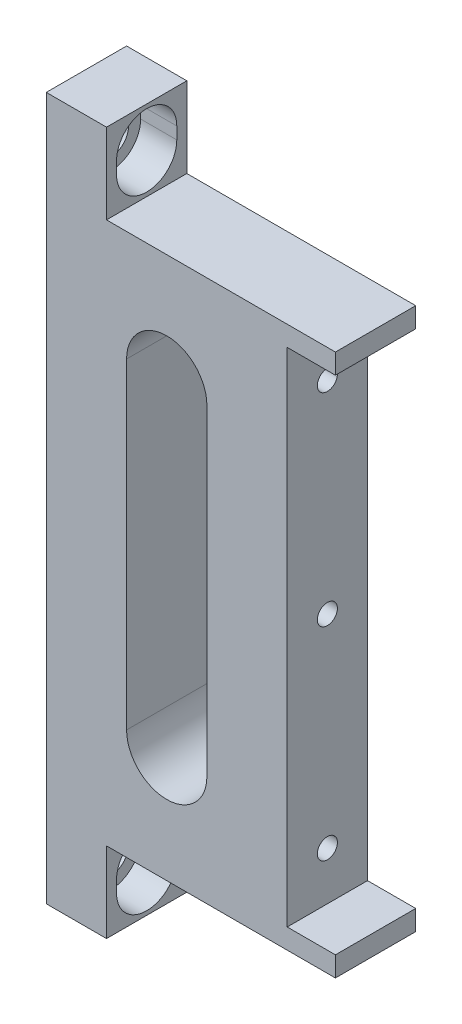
ISO-10303-21;
HEADER;
FILE_DESCRIPTION(('STEP AP214'),'2;1');
FILE_NAME('part.step','',(''),(''),'','','');
FILE_SCHEMA(('AUTOMOTIVE_DESIGN { 1 0 10303 214 1 1 1 1 }'));
ENDSEC;
DATA;
#1=APPLICATION_CONTEXT('core data for automotive mechanical design processes');
#2=APPLICATION_PROTOCOL_DEFINITION('international standard','automotive_design',2000,#1);
#3=PRODUCT_CONTEXT('',#1,'mechanical');
#4=PRODUCT('Part','Part','',(#3));
#5=PRODUCT_RELATED_PRODUCT_CATEGORY('part','',(#4));
#6=PRODUCT_DEFINITION_FORMATION('','',#4);
#7=PRODUCT_DEFINITION_CONTEXT('part definition',#1,'design');
#8=PRODUCT_DEFINITION('design','',#6,#7);
#9=PRODUCT_DEFINITION_SHAPE('','',#8);
#10=(LENGTH_UNIT() NAMED_UNIT(*) SI_UNIT(.MILLI.,.METRE.));
#11=(NAMED_UNIT(*) PLANE_ANGLE_UNIT() SI_UNIT($,.RADIAN.));
#12=(NAMED_UNIT(*) SI_UNIT($,.STERADIAN.) SOLID_ANGLE_UNIT());
#13=UNCERTAINTY_MEASURE_WITH_UNIT(LENGTH_MEASURE(1.E-05),#10,'distance_accuracy_value','');
#14=(GEOMETRIC_REPRESENTATION_CONTEXT(3) GLOBAL_UNCERTAINTY_ASSIGNED_CONTEXT((#13)) GLOBAL_UNIT_ASSIGNED_CONTEXT((#10,
#11,#12)) REPRESENTATION_CONTEXT('',''));
#15=CARTESIAN_POINT('',(0.,0.,0.));
#16=DIRECTION('',(0.,0.,1.));
#17=DIRECTION('',(1.,0.,0.));
#18=AXIS2_PLACEMENT_3D('',#15,#16,#17);
#19=CARTESIAN_POINT('',(0.,-67.5,20.));
#20=DIRECTION('',(0.,-1.,0.));
#21=DIRECTION('',(1.,0.,0.));
#22=AXIS2_PLACEMENT_3D('',#19,#20,#21);
#23=PLANE('',#22);
#24=DIRECTION('',(-1.,0.,0.));
#25=VECTOR('',#24,1.);
#26=CARTESIAN_POINT('',(0.,-67.5,0.));
#27=LINE('',#26,#25);
#28=CARTESIAN_POINT('',(0.,-67.5,0.));
#29=VERTEX_POINT('',#28);
#30=CARTESIAN_POINT('',(-57.,-67.5,0.));
#31=VERTEX_POINT('',#30);
#32=EDGE_CURVE('E432',#29,#31,#27,.T.);
#33=ORIENTED_EDGE('',*,*,#32,.F.);
#34=DIRECTION('',(0.,0.,-1.));
#35=VECTOR('',#34,1.);
#36=CARTESIAN_POINT('',(0.,-67.5,20.));
#37=LINE('',#36,#35);
#38=CARTESIAN_POINT('',(0.,-67.5,20.));
#39=VERTEX_POINT('',#38);
#40=EDGE_CURVE('E11',#39,#29,#37,.T.);
#41=ORIENTED_EDGE('',*,*,#40,.F.);
#42=DIRECTION('',(-1.,0.,0.));
#43=VECTOR('',#42,1.);
#44=CARTESIAN_POINT('',(0.,-67.5,20.));
#45=LINE('',#44,#43);
#46=CARTESIAN_POINT('',(-57.,-67.5,20.));
#47=VERTEX_POINT('',#46);
#48=EDGE_CURVE('E388',#39,#47,#45,.T.);
#49=ORIENTED_EDGE('',*,*,#48,.T.);
#50=DIRECTION('',(0.,0.,-1.));
#51=VECTOR('',#50,1.);
#52=CARTESIAN_POINT('',(-57.,-67.5,20.));
#53=LINE('',#52,#51);
#54=EDGE_CURVE('E467',#47,#31,#53,.T.);
#55=ORIENTED_EDGE('',*,*,#54,.T.);
#56=EDGE_LOOP('',(#33,#41,#49,#55));
#57=FACE_BOUND('',#56,.T.);
#58=ADVANCED_FACE('F16',(#57),#23,.T.);
#59=CARTESIAN_POINT('',(0.,0.,20.));
#60=DIRECTION('',(1.,0.,0.));
#61=DIRECTION('',(0.,1.,0.));
#62=AXIS2_PLACEMENT_3D('',#59,#60,#61);
#63=PLANE('',#62);
#64=DIRECTION('',(0.,-1.,0.));
#65=VECTOR('',#64,1.);
#66=CARTESIAN_POINT('',(0.,0.,0.));
#67=LINE('',#66,#65);
#68=CARTESIAN_POINT('',(0.,-62.5,0.));
#69=VERTEX_POINT('',#68);
#70=EDGE_CURVE('E435',#69,#29,#67,.T.);
#71=ORIENTED_EDGE('',*,*,#70,.F.);
#72=DIRECTION('',(0.,0.,-1.));
#73=VECTOR('',#72,1.);
#74=CARTESIAN_POINT('',(0.,-62.5,20.));
#75=LINE('',#74,#73);
#76=CARTESIAN_POINT('',(0.,-62.5,20.));
#77=VERTEX_POINT('',#76);
#78=EDGE_CURVE('E25',#77,#69,#75,.T.);
#79=ORIENTED_EDGE('',*,*,#78,.F.);
#80=DIRECTION('',(0.,-1.,0.));
#81=VECTOR('',#80,1.);
#82=CARTESIAN_POINT('',(0.,0.,20.));
#83=LINE('',#82,#81);
#84=EDGE_CURVE('E391',#77,#39,#83,.T.);
#85=ORIENTED_EDGE('',*,*,#84,.T.);
#86=ORIENTED_EDGE('',*,*,#40,.T.);
#87=EDGE_LOOP('',(#71,#79,#85,#86));
#88=FACE_BOUND('',#87,.T.);
#89=ADVANCED_FACE('F525',(#88),#63,.T.);
#90=CARTESIAN_POINT('',(0.,-62.5,20.));
#91=DIRECTION('',(0.,-1.,0.));
#92=DIRECTION('',(0.,0.,-1.));
#93=AXIS2_PLACEMENT_3D('',#90,#91,#92);
#94=PLANE('',#93);
#95=DIRECTION('',(-1.,0.,0.));
#96=VECTOR('',#95,1.);
#97=CARTESIAN_POINT('',(0.,-62.5,0.));
#98=LINE('',#97,#96);
#99=CARTESIAN_POINT('',(-12.,-62.5,0.));
#100=VERTEX_POINT('',#99);
#101=EDGE_CURVE('E438',#69,#100,#98,.T.);
#102=ORIENTED_EDGE('',*,*,#101,.T.);
#103=DIRECTION('',(0.,0.,-1.));
#104=VECTOR('',#103,1.);
#105=CARTESIAN_POINT('',(-12.,-62.5,20.));
#106=LINE('',#105,#104);
#107=CARTESIAN_POINT('',(-12.,-62.5,20.));
#108=VERTEX_POINT('',#107);
#109=EDGE_CURVE('E488',#108,#100,#106,.T.);
#110=ORIENTED_EDGE('',*,*,#109,.F.);
#111=DIRECTION('',(-1.,0.,0.));
#112=VECTOR('',#111,1.);
#113=CARTESIAN_POINT('',(0.,-62.5,20.));
#114=LINE('',#113,#112);
#115=EDGE_CURVE('E394',#77,#108,#114,.T.);
#116=ORIENTED_EDGE('',*,*,#115,.F.);
#117=ORIENTED_EDGE('',*,*,#78,.T.);
#118=EDGE_LOOP('',(#102,#110,#116,#117));
#119=FACE_BOUND('',#118,.T.);
#120=ADVANCED_FACE('F531',(#119),#94,.F.);
#121=CARTESIAN_POINT('',(-12.,0.,20.));
#122=DIRECTION('',(1.,0.,0.));
#123=DIRECTION('',(0.,1.,0.));
#124=AXIS2_PLACEMENT_3D('',#121,#122,#123);
#125=PLANE('',#124);
#126=CARTESIAN_POINT('',(-12.,50.5,10.));
#127=DIRECTION('',(1.,0.,0.));
#128=DIRECTION('',(0.,0.,-1.));
#129=AXIS2_PLACEMENT_3D('',#126,#127,#128);
#130=CIRCLE('',#129,2.5);
#131=CARTESIAN_POINT('',(-12.,50.5,7.5));
#132=VERTEX_POINT('',#131);
#133=EDGE_CURVE('E357',#132,#132,#130,.T.);
#134=ORIENTED_EDGE('',*,*,#133,.F.);
#135=EDGE_LOOP('',(#134));
#136=FACE_BOUND('',#135,.T.);
#137=CARTESIAN_POINT('',(-12.,0.,10.));
#138=DIRECTION('',(1.,0.,0.));
#139=DIRECTION('',(0.,0.,-1.));
#140=AXIS2_PLACEMENT_3D('',#137,#138,#139);
#141=CIRCLE('',#140,2.5);
#142=CARTESIAN_POINT('',(-12.,0.,7.5));
#143=VERTEX_POINT('',#142);
#144=EDGE_CURVE('E363',#143,#143,#141,.T.);
#145=ORIENTED_EDGE('',*,*,#144,.F.);
#146=EDGE_LOOP('',(#145));
#147=FACE_BOUND('',#146,.T.);
#148=CARTESIAN_POINT('',(-12.,-50.5,10.));
#149=DIRECTION('',(1.,0.,0.));
#150=DIRECTION('',(0.,0.,-1.));
#151=AXIS2_PLACEMENT_3D('',#148,#149,#150);
#152=CIRCLE('',#151,2.5);
#153=CARTESIAN_POINT('',(-12.,-50.5,7.5));
#154=VERTEX_POINT('',#153);
#155=EDGE_CURVE('E369',#154,#154,#152,.T.);
#156=ORIENTED_EDGE('',*,*,#155,.F.);
#157=EDGE_LOOP('',(#156));
#158=FACE_BOUND('',#157,.T.);
#159=DIRECTION('',(0.,-1.,0.));
#160=VECTOR('',#159,1.);
#161=CARTESIAN_POINT('',(-12.,0.,0.));
#162=LINE('',#161,#160);
#163=CARTESIAN_POINT('',(-12.,62.5,0.));
#164=VERTEX_POINT('',#163);
#165=EDGE_CURVE('E441',#164,#100,#162,.T.);
#166=ORIENTED_EDGE('',*,*,#165,.F.);
#167=DIRECTION('',(0.,0.,-1.));
#168=VECTOR('',#167,1.);
#169=CARTESIAN_POINT('',(-12.,62.5,20.));
#170=LINE('',#169,#168);
#171=CARTESIAN_POINT('',(-12.,62.5,20.));
#172=VERTEX_POINT('',#171);
#173=EDGE_CURVE('E486',#172,#164,#170,.T.);
#174=ORIENTED_EDGE('',*,*,#173,.F.);
#175=DIRECTION('',(0.,-1.,0.));
#176=VECTOR('',#175,1.);
#177=CARTESIAN_POINT('',(-12.,0.,20.));
#178=LINE('',#177,#176);
#179=EDGE_CURVE('E396',#172,#108,#178,.T.);
#180=ORIENTED_EDGE('',*,*,#179,.T.);
#181=ORIENTED_EDGE('',*,*,#109,.T.);
#182=EDGE_LOOP('',(#166,#174,#180,#181));
#183=FACE_BOUND('',#182,.T.);
#184=ADVANCED_FACE('F538',(#136,#147,#158,#183),#125,.T.);
#185=CARTESIAN_POINT('',(0.,62.5,20.));
#186=DIRECTION('',(0.,1.,0.));
#187=DIRECTION('',(0.,0.,1.));
#188=AXIS2_PLACEMENT_3D('',#185,#186,#187);
#189=PLANE('',#188);
#190=DIRECTION('',(1.,0.,0.));
#191=VECTOR('',#190,1.);
#192=CARTESIAN_POINT('',(0.,62.5,0.));
#193=LINE('',#192,#191);
#194=CARTESIAN_POINT('',(0.,62.5,0.));
#195=VERTEX_POINT('',#194);
#196=EDGE_CURVE('E444',#164,#195,#193,.T.);
#197=ORIENTED_EDGE('',*,*,#196,.T.);
#198=DIRECTION('',(0.,0.,-1.));
#199=VECTOR('',#198,1.);
#200=CARTESIAN_POINT('',(0.,62.5,20.));
#201=LINE('',#200,#199);
#202=CARTESIAN_POINT('',(0.,62.5,20.));
#203=VERTEX_POINT('',#202);
#204=EDGE_CURVE('E484',#203,#195,#201,.T.);
#205=ORIENTED_EDGE('',*,*,#204,.F.);
#206=DIRECTION('',(1.,0.,0.));
#207=VECTOR('',#206,1.);
#208=CARTESIAN_POINT('',(0.,62.5,20.));
#209=LINE('',#208,#207);
#210=EDGE_CURVE('E399',#172,#203,#209,.T.);
#211=ORIENTED_EDGE('',*,*,#210,.F.);
#212=ORIENTED_EDGE('',*,*,#173,.T.);
#213=EDGE_LOOP('',(#197,#205,#211,#212));
#214=FACE_BOUND('',#213,.T.);
#215=ADVANCED_FACE('F541',(#214),#189,.F.);
#216=CARTESIAN_POINT('',(2.26229200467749E-13,0.,20.));
#217=DIRECTION('',(1.,0.,0.));
#218=DIRECTION('',(0.,1.,0.));
#219=AXIS2_PLACEMENT_3D('',#216,#217,#218);
#220=PLANE('',#219);
#221=DIRECTION('',(0.,-1.,0.));
#222=VECTOR('',#221,1.);
#223=CARTESIAN_POINT('',(2.26229200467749E-13,0.,0.));
#224=LINE('',#223,#222);
#225=CARTESIAN_POINT('',(0.,67.5,0.));
#226=VERTEX_POINT('',#225);
#227=EDGE_CURVE('E447',#226,#195,#224,.T.);
#228=ORIENTED_EDGE('',*,*,#227,.F.);
#229=DIRECTION('',(0.,0.,-1.));
#230=VECTOR('',#229,1.);
#231=CARTESIAN_POINT('',(0.,67.5,20.));
#232=LINE('',#231,#230);
#233=CARTESIAN_POINT('',(0.,67.5,20.));
#234=VERTEX_POINT('',#233);
#235=EDGE_CURVE('E482',#234,#226,#232,.T.);
#236=ORIENTED_EDGE('',*,*,#235,.F.);
#237=DIRECTION('',(0.,-1.,0.));
#238=VECTOR('',#237,1.);
#239=CARTESIAN_POINT('',(2.26229200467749E-13,0.,20.));
#240=LINE('',#239,#238);
#241=EDGE_CURVE('E401',#234,#203,#240,.T.);
#242=ORIENTED_EDGE('',*,*,#241,.T.);
#243=ORIENTED_EDGE('',*,*,#204,.T.);
#244=EDGE_LOOP('',(#228,#236,#242,#243));
#245=FACE_BOUND('',#244,.T.);
#246=ADVANCED_FACE('F544',(#245),#220,.T.);
#247=CARTESIAN_POINT('',(0.,67.5,20.));
#248=DIRECTION('',(0.,-1.,0.));
#249=DIRECTION('',(1.,0.,0.));
#250=AXIS2_PLACEMENT_3D('',#247,#248,#249);
#251=PLANE('',#250);
#252=DIRECTION('',(-1.,0.,0.));
#253=VECTOR('',#252,1.);
#254=CARTESIAN_POINT('',(0.,67.5,0.));
#255=LINE('',#254,#253);
#256=CARTESIAN_POINT('',(-57.,67.5,0.));
#257=VERTEX_POINT('',#256);
#258=EDGE_CURVE('E450',#226,#257,#255,.T.);
#259=ORIENTED_EDGE('',*,*,#258,.T.);
#260=DIRECTION('',(0.,0.,-1.));
#261=VECTOR('',#260,1.);
#262=CARTESIAN_POINT('',(-57.,67.5,20.));
#263=LINE('',#262,#261);
#264=CARTESIAN_POINT('',(-57.,67.5,20.));
#265=VERTEX_POINT('',#264);
#266=EDGE_CURVE('E479',#265,#257,#263,.T.);
#267=ORIENTED_EDGE('',*,*,#266,.F.);
#268=DIRECTION('',(-1.,0.,0.));
#269=VECTOR('',#268,1.);
#270=CARTESIAN_POINT('',(0.,67.5,20.));
#271=LINE('',#270,#269);
#272=EDGE_CURVE('E404',#234,#265,#271,.T.);
#273=ORIENTED_EDGE('',*,*,#272,.F.);
#274=ORIENTED_EDGE('',*,*,#235,.T.);
#275=EDGE_LOOP('',(#259,#267,#273,#274));
#276=FACE_BOUND('',#275,.T.);
#277=ADVANCED_FACE('F550',(#276),#251,.F.);
#278=CARTESIAN_POINT('',(-57.,0.,20.));
#279=DIRECTION('',(-1.,0.,0.));
#280=DIRECTION('',(0.,-1.,0.));
#281=AXIS2_PLACEMENT_3D('',#278,#279,#280);
#282=PLANE('',#281);
#283=DIRECTION('',(0.,1.,0.));
#284=VECTOR('',#283,1.);
#285=CARTESIAN_POINT('',(-57.,76.,2.5));
#286=LINE('',#285,#284);
#287=CARTESIAN_POINT('',(-57.,76.,2.5));
#288=VERTEX_POINT('',#287);
#289=CARTESIAN_POINT('',(-57.,79.,2.5));
#290=VERTEX_POINT('',#289);
#291=EDGE_CURVE('E263',#288,#290,#286,.T.);
#292=ORIENTED_EDGE('',*,*,#291,.F.);
#293=CARTESIAN_POINT('',(-57.,76.,10.));
#294=DIRECTION('',(1.,0.,0.));
#295=DIRECTION('',(0.,0.,-1.));
#296=AXIS2_PLACEMENT_3D('',#293,#294,#295);
#297=CIRCLE('',#296,7.5);
#298=CARTESIAN_POINT('',(-57.,76.,17.5));
#299=VERTEX_POINT('',#298);
#300=EDGE_CURVE('E254',#299,#288,#297,.T.);
#301=ORIENTED_EDGE('',*,*,#300,.F.);
#302=DIRECTION('',(0.,1.,0.));
#303=VECTOR('',#302,1.);
#304=CARTESIAN_POINT('',(-57.,76.,17.5));
#305=LINE('',#304,#303);
#306=CARTESIAN_POINT('',(-57.,79.,17.5));
#307=VERTEX_POINT('',#306);
#308=EDGE_CURVE('E237',#299,#307,#305,.T.);
#309=ORIENTED_EDGE('',*,*,#308,.T.);
#310=CARTESIAN_POINT('',(-57.,79.,10.));
#311=DIRECTION('',(1.,0.,0.));
#312=DIRECTION('',(0.,0.,-1.));
#313=AXIS2_PLACEMENT_3D('',#310,#311,#312);
#314=CIRCLE('',#313,7.5);
#315=EDGE_CURVE('E280',#290,#307,#314,.T.);
#316=ORIENTED_EDGE('',*,*,#315,.F.);
#317=EDGE_LOOP('',(#292,#301,#309,#316));
#318=FACE_BOUND('',#317,.T.);
#319=DIRECTION('',(0.,1.,0.));
#320=VECTOR('',#319,1.);
#321=CARTESIAN_POINT('',(-57.,0.,0.));
#322=LINE('',#321,#320);
#323=CARTESIAN_POINT('',(-57.,87.5,0.));
#324=VERTEX_POINT('',#323);
#325=EDGE_CURVE('E453',#257,#324,#322,.T.);
#326=ORIENTED_EDGE('',*,*,#325,.T.);
#327=DIRECTION('',(0.,0.,-1.));
#328=VECTOR('',#327,1.);
#329=CARTESIAN_POINT('',(-57.,87.5,20.));
#330=LINE('',#329,#328);
#331=CARTESIAN_POINT('',(-57.,87.5,20.));
#332=VERTEX_POINT('',#331);
#333=EDGE_CURVE('E477',#332,#324,#330,.T.);
#334=ORIENTED_EDGE('',*,*,#333,.F.);
#335=DIRECTION('',(0.,1.,0.));
#336=VECTOR('',#335,1.);
#337=CARTESIAN_POINT('',(-57.,0.,20.));
#338=LINE('',#337,#336);
#339=EDGE_CURVE('E407',#265,#332,#338,.T.);
#340=ORIENTED_EDGE('',*,*,#339,.F.);
#341=ORIENTED_EDGE('',*,*,#266,.T.);
#342=EDGE_LOOP('',(#326,#334,#340,#341));
#343=FACE_BOUND('',#342,.T.);
#344=ADVANCED_FACE('F261',(#318,#343),#282,.F.);
#345=CARTESIAN_POINT('',(0.,87.5,20.));
#346=DIRECTION('',(0.,1.,0.));
#347=DIRECTION('',(0.,0.,1.));
#348=AXIS2_PLACEMENT_3D('',#345,#346,#347);
#349=PLANE('',#348);
#350=DIRECTION('',(1.,0.,0.));
#351=VECTOR('',#350,1.);
#352=CARTESIAN_POINT('',(0.,87.5,0.));
#353=LINE('',#352,#351);
#354=CARTESIAN_POINT('',(-72.,87.5,0.));
#355=VERTEX_POINT('',#354);
#356=EDGE_CURVE('E456',#355,#324,#353,.T.);
#357=ORIENTED_EDGE('',*,*,#356,.F.);
#358=DIRECTION('',(0.,0.,-1.));
#359=VECTOR('',#358,1.);
#360=CARTESIAN_POINT('',(-72.,87.5,20.));
#361=LINE('',#360,#359);
#362=CARTESIAN_POINT('',(-72.,87.5,20.));
#363=VERTEX_POINT('',#362);
#364=EDGE_CURVE('E475',#363,#355,#361,.T.);
#365=ORIENTED_EDGE('',*,*,#364,.F.);
#366=DIRECTION('',(1.,0.,0.));
#367=VECTOR('',#366,1.);
#368=CARTESIAN_POINT('',(0.,87.5,20.));
#369=LINE('',#368,#367);
#370=EDGE_CURVE('E409',#363,#332,#369,.T.);
#371=ORIENTED_EDGE('',*,*,#370,.T.);
#372=ORIENTED_EDGE('',*,*,#333,.T.);
#373=EDGE_LOOP('',(#357,#365,#371,#372));
#374=FACE_BOUND('',#373,.T.);
#375=ADVANCED_FACE('F554',(#374),#349,.T.);
#376=CARTESIAN_POINT('',(-72.,0.,20.));
#377=DIRECTION('',(1.,0.,0.));
#378=DIRECTION('',(0.,1.,0.));
#379=AXIS2_PLACEMENT_3D('',#376,#377,#378);
#380=PLANE('',#379);
#381=DIRECTION('',(0.,1.,0.));
#382=VECTOR('',#381,1.);
#383=CARTESIAN_POINT('',(-72.,76.,14.5));
#384=LINE('',#383,#382);
#385=CARTESIAN_POINT('',(-72.,76.,14.5));
#386=VERTEX_POINT('',#385);
#387=CARTESIAN_POINT('',(-72.,79.,14.5));
#388=VERTEX_POINT('',#387);
#389=EDGE_CURVE('E949',#386,#388,#384,.T.);
#390=ORIENTED_EDGE('',*,*,#389,.F.);
#391=CARTESIAN_POINT('',(-72.,76.,10.));
#392=DIRECTION('',(1.,0.,0.));
#393=DIRECTION('',(0.,0.,-1.));
#394=AXIS2_PLACEMENT_3D('',#391,#392,#393);
#395=CIRCLE('',#394,4.5);
#396=CARTESIAN_POINT('',(-72.,76.,5.5));
#397=VERTEX_POINT('',#396);
#398=EDGE_CURVE('E273',#386,#397,#395,.T.);
#399=ORIENTED_EDGE('',*,*,#398,.T.);
#400=DIRECTION('',(0.,1.,0.));
#401=VECTOR('',#400,1.);
#402=CARTESIAN_POINT('',(-72.,76.,5.5));
#403=LINE('',#402,#401);
#404=CARTESIAN_POINT('',(-72.,79.,5.5));
#405=VERTEX_POINT('',#404);
#406=EDGE_CURVE('E944',#397,#405,#403,.T.);
#407=ORIENTED_EDGE('',*,*,#406,.T.);
#408=CARTESIAN_POINT('',(-72.,79.,10.));
#409=DIRECTION('',(1.,0.,0.));
#410=DIRECTION('',(0.,0.,-1.));
#411=AXIS2_PLACEMENT_3D('',#408,#409,#410);
#412=CIRCLE('',#411,4.5);
#413=EDGE_CURVE('E288',#405,#388,#412,.T.);
#414=ORIENTED_EDGE('',*,*,#413,.T.);
#415=EDGE_LOOP('',(#390,#399,#407,#414));
#416=FACE_BOUND('',#415,.T.);
#417=CARTESIAN_POINT('',(-72.,-76.,10.));
#418=DIRECTION('',(1.,0.,0.));
#419=DIRECTION('',(0.,0.,-1.));
#420=AXIS2_PLACEMENT_3D('',#417,#418,#419);
#421=CIRCLE('',#420,4.5);
#422=CARTESIAN_POINT('',(-72.,-76.,5.5));
#423=VERTEX_POINT('',#422);
#424=CARTESIAN_POINT('',(-72.,-76.,14.5));
#425=VERTEX_POINT('',#424);
#426=EDGE_CURVE('E349',#423,#425,#421,.T.);
#427=ORIENTED_EDGE('',*,*,#426,.T.);
#428=DIRECTION('',(0.,1.,0.));
#429=VECTOR('',#428,1.);
#430=CARTESIAN_POINT('',(-72.,-79.,14.5));
#431=LINE('',#430,#429);
#432=CARTESIAN_POINT('',(-72.,-79.,14.5));
#433=VERTEX_POINT('',#432);
#434=EDGE_CURVE('E304',#433,#425,#431,.T.);
#435=ORIENTED_EDGE('',*,*,#434,.F.);
#436=CARTESIAN_POINT('',(-72.,-79.,10.));
#437=DIRECTION('',(1.,0.,0.));
#438=DIRECTION('',(0.,0.,-1.));
#439=AXIS2_PLACEMENT_3D('',#436,#437,#438);
#440=CIRCLE('',#439,4.5);
#441=CARTESIAN_POINT('',(-72.,-79.,5.5));
#442=VERTEX_POINT('',#441);
#443=EDGE_CURVE('E326',#433,#442,#440,.T.);
#444=ORIENTED_EDGE('',*,*,#443,.T.);
#445=DIRECTION('',(0.,1.,0.));
#446=VECTOR('',#445,1.);
#447=CARTESIAN_POINT('',(-72.,-79.,5.5));
#448=LINE('',#447,#446);
#449=EDGE_CURVE('E301',#442,#423,#448,.T.);
#450=ORIENTED_EDGE('',*,*,#449,.T.);
#451=EDGE_LOOP('',(#427,#435,#444,#450));
#452=FACE_BOUND('',#451,.T.);
#453=DIRECTION('',(0.,-1.,0.));
#454=VECTOR('',#453,1.);
#455=CARTESIAN_POINT('',(-72.,0.,0.));
#456=LINE('',#455,#454);
#457=CARTESIAN_POINT('',(-72.,-87.5,0.));
#458=VERTEX_POINT('',#457);
#459=EDGE_CURVE('E459',#355,#458,#456,.T.);
#460=ORIENTED_EDGE('',*,*,#459,.T.);
#461=DIRECTION('',(0.,0.,-1.));
#462=VECTOR('',#461,1.);
#463=CARTESIAN_POINT('',(-72.,-87.5,20.));
#464=LINE('',#463,#462);
#465=CARTESIAN_POINT('',(-72.,-87.5,20.));
#466=VERTEX_POINT('',#465);
#467=EDGE_CURVE('E472',#466,#458,#464,.T.);
#468=ORIENTED_EDGE('',*,*,#467,.F.);
#469=DIRECTION('',(0.,-1.,0.));
#470=VECTOR('',#469,1.);
#471=CARTESIAN_POINT('',(-72.,0.,20.));
#472=LINE('',#471,#470);
#473=EDGE_CURVE('E412',#363,#466,#472,.T.);
#474=ORIENTED_EDGE('',*,*,#473,.F.);
#475=ORIENTED_EDGE('',*,*,#364,.T.);
#476=EDGE_LOOP('',(#460,#468,#474,#475));
#477=FACE_BOUND('',#476,.T.);
#478=ADVANCED_FACE('F559',(#416,#452,#477),#380,.F.);
#479=CARTESIAN_POINT('',(0.,-87.5,20.));
#480=DIRECTION('',(0.,1.,0.));
#481=DIRECTION('',(0.,0.,1.));
#482=AXIS2_PLACEMENT_3D('',#479,#480,#481);
#483=PLANE('',#482);
#484=DIRECTION('',(1.,0.,0.));
#485=VECTOR('',#484,1.);
#486=CARTESIAN_POINT('',(0.,-87.5,0.));
#487=LINE('',#486,#485);
#488=CARTESIAN_POINT('',(-57.,-87.5,0.));
#489=VERTEX_POINT('',#488);
#490=EDGE_CURVE('E462',#458,#489,#487,.T.);
#491=ORIENTED_EDGE('',*,*,#490,.T.);
#492=DIRECTION('',(0.,0.,-1.));
#493=VECTOR('',#492,1.);
#494=CARTESIAN_POINT('',(-57.,-87.5,20.));
#495=LINE('',#494,#493);
#496=CARTESIAN_POINT('',(-57.,-87.5,20.));
#497=VERTEX_POINT('',#496);
#498=EDGE_CURVE('E469',#497,#489,#495,.T.);
#499=ORIENTED_EDGE('',*,*,#498,.F.);
#500=DIRECTION('',(1.,0.,0.));
#501=VECTOR('',#500,1.);
#502=CARTESIAN_POINT('',(0.,-87.5,20.));
#503=LINE('',#502,#501);
#504=EDGE_CURVE('E415',#466,#497,#503,.T.);
#505=ORIENTED_EDGE('',*,*,#504,.F.);
#506=ORIENTED_EDGE('',*,*,#467,.T.);
#507=EDGE_LOOP('',(#491,#499,#505,#506));
#508=FACE_BOUND('',#507,.T.);
#509=ADVANCED_FACE('F562',(#508),#483,.F.);
#510=CARTESIAN_POINT('',(-42.,-40.,20.));
#511=DIRECTION('',(0.,0.,-1.));
#512=DIRECTION('',(-1.,0.,0.));
#513=AXIS2_PLACEMENT_3D('',#510,#511,#512);
#514=CYLINDRICAL_SURFACE('',#513,10.);
#515=CARTESIAN_POINT('',(-42.,-40.,0.));
#516=DIRECTION('',(0.,0.,1.));
#517=DIRECTION('',(1.,0.,0.));
#518=AXIS2_PLACEMENT_3D('',#515,#516,#517);
#519=CIRCLE('',#518,10.);
#520=CARTESIAN_POINT('',(-52.,-40.,0.));
#521=VERTEX_POINT('',#520);
#522=CARTESIAN_POINT('',(-32.,-40.,0.));
#523=VERTEX_POINT('',#522);
#524=EDGE_CURVE('E375',#521,#523,#519,.T.);
#525=ORIENTED_EDGE('',*,*,#524,.F.);
#526=DIRECTION('',(0.,0.,-1.));
#527=VECTOR('',#526,1.);
#528=CARTESIAN_POINT('',(-52.,-40.,20.));
#529=LINE('',#528,#527);
#530=CARTESIAN_POINT('',(-52.,-40.,20.));
#531=VERTEX_POINT('',#530);
#532=EDGE_CURVE('E20',#531,#521,#529,.T.);
#533=ORIENTED_EDGE('',*,*,#532,.F.);
#534=CARTESIAN_POINT('',(-42.,-40.,20.));
#535=DIRECTION('',(0.,0.,1.));
#536=DIRECTION('',(1.,0.,0.));
#537=AXIS2_PLACEMENT_3D('',#534,#535,#536);
#538=CIRCLE('',#537,10.);
#539=CARTESIAN_POINT('',(-32.,-40.,20.));
#540=VERTEX_POINT('',#539);
#541=EDGE_CURVE('E376',#531,#540,#538,.T.);
#542=ORIENTED_EDGE('',*,*,#541,.T.);
#543=DIRECTION('',(0.,0.,-1.));
#544=VECTOR('',#543,1.);
#545=CARTESIAN_POINT('',(-32.,-40.,20.));
#546=LINE('',#545,#544);
#547=EDGE_CURVE('E420',#540,#523,#546,.T.);
#548=ORIENTED_EDGE('',*,*,#547,.T.);
#549=EDGE_LOOP('',(#525,#533,#542,#548));
#550=FACE_BOUND('',#549,.T.);
#551=ADVANCED_FACE('F18',(#550),#514,.F.);
#552=CARTESIAN_POINT('',(-52.,0.,20.));
#553=DIRECTION('',(1.,0.,0.));
#554=DIRECTION('',(0.,1.,0.));
#555=AXIS2_PLACEMENT_3D('',#552,#553,#554);
#556=PLANE('',#555);
#557=DIRECTION('',(0.,-1.,0.));
#558=VECTOR('',#557,1.);
#559=CARTESIAN_POINT('',(-52.,0.,0.));
#560=LINE('',#559,#558);
#561=CARTESIAN_POINT('',(-52.,40.,0.));
#562=VERTEX_POINT('',#561);
#563=EDGE_CURVE('E423',#562,#521,#560,.T.);
#564=ORIENTED_EDGE('',*,*,#563,.F.);
#565=DIRECTION('',(0.,0.,-1.));
#566=VECTOR('',#565,1.);
#567=CARTESIAN_POINT('',(-52.,40.,20.));
#568=LINE('',#567,#566);
#569=CARTESIAN_POINT('',(-52.,40.,20.));
#570=VERTEX_POINT('',#569);
#571=EDGE_CURVE('E493',#570,#562,#568,.T.);
#572=ORIENTED_EDGE('',*,*,#571,.F.);
#573=DIRECTION('',(0.,-1.,0.));
#574=VECTOR('',#573,1.);
#575=CARTESIAN_POINT('',(-52.,0.,20.));
#576=LINE('',#575,#574);
#577=EDGE_CURVE('E379',#570,#531,#576,.T.);
#578=ORIENTED_EDGE('',*,*,#577,.T.);
#579=ORIENTED_EDGE('',*,*,#532,.T.);
#580=EDGE_LOOP('',(#564,#572,#578,#579));
#581=FACE_BOUND('',#580,.T.);
#582=ADVANCED_FACE('F499',(#581),#556,.T.);
#583=CARTESIAN_POINT('',(-42.,40.,20.));
#584=DIRECTION('',(0.,0.,-1.));
#585=DIRECTION('',(-1.,0.,0.));
#586=AXIS2_PLACEMENT_3D('',#583,#584,#585);
#587=CYLINDRICAL_SURFACE('',#586,10.);
#588=CARTESIAN_POINT('',(-42.,40.,0.));
#589=DIRECTION('',(0.,0.,1.));
#590=DIRECTION('',(1.,0.,0.));
#591=AXIS2_PLACEMENT_3D('',#588,#589,#590);
#592=CIRCLE('',#591,10.);
#593=CARTESIAN_POINT('',(-32.,40.,0.));
#594=VERTEX_POINT('',#593);
#595=EDGE_CURVE('E426',#594,#562,#592,.T.);
#596=ORIENTED_EDGE('',*,*,#595,.F.);
#597=DIRECTION('',(0.,0.,-1.));
#598=VECTOR('',#597,1.);
#599=CARTESIAN_POINT('',(-32.,40.,20.));
#600=LINE('',#599,#598);
#601=CARTESIAN_POINT('',(-32.,40.,20.));
#602=VERTEX_POINT('',#601);
#603=EDGE_CURVE('E492',#602,#594,#600,.T.);
#604=ORIENTED_EDGE('',*,*,#603,.F.);
#605=CARTESIAN_POINT('',(-42.,40.,20.));
#606=DIRECTION('',(0.,0.,1.));
#607=DIRECTION('',(1.,0.,0.));
#608=AXIS2_PLACEMENT_3D('',#605,#606,#607);
#609=CIRCLE('',#608,10.);
#610=EDGE_CURVE('E383',#602,#570,#609,.T.);
#611=ORIENTED_EDGE('',*,*,#610,.T.);
#612=ORIENTED_EDGE('',*,*,#571,.T.);
#613=EDGE_LOOP('',(#596,#604,#611,#612));
#614=FACE_BOUND('',#613,.T.);
#615=ADVANCED_FACE('F508',(#614),#587,.F.);
#616=CARTESIAN_POINT('',(-32.,0.,20.));
#617=DIRECTION('',(1.,0.,0.));
#618=DIRECTION('',(0.,1.,0.));
#619=AXIS2_PLACEMENT_3D('',#616,#617,#618);
#620=PLANE('',#619);
#621=DIRECTION('',(0.,-1.,0.));
#622=VECTOR('',#621,1.);
#623=CARTESIAN_POINT('',(-32.,0.,0.));
#624=LINE('',#623,#622);
#625=EDGE_CURVE('E429',#594,#523,#624,.T.);
#626=ORIENTED_EDGE('',*,*,#625,.T.);
#627=ORIENTED_EDGE('',*,*,#547,.F.);
#628=DIRECTION('',(0.,-1.,0.));
#629=VECTOR('',#628,1.);
#630=CARTESIAN_POINT('',(-32.,0.,20.));
#631=LINE('',#630,#629);
#632=EDGE_CURVE('E386',#602,#540,#631,.T.);
#633=ORIENTED_EDGE('',*,*,#632,.F.);
#634=ORIENTED_EDGE('',*,*,#603,.T.);
#635=EDGE_LOOP('',(#626,#627,#633,#634));
#636=FACE_BOUND('',#635,.T.);
#637=ADVANCED_FACE('F512',(#636),#620,.F.);
#638=CARTESIAN_POINT('',(-57.,0.,20.));
#639=DIRECTION('',(-1.,0.,0.));
#640=DIRECTION('',(0.,0.,1.));
#641=AXIS2_PLACEMENT_3D('',#638,#639,#640);
#642=PLANE('',#641);
#643=CARTESIAN_POINT('',(-57.,-79.,10.));
#644=DIRECTION('',(1.,0.,0.));
#645=DIRECTION('',(0.,0.,-1.));
#646=AXIS2_PLACEMENT_3D('',#643,#644,#645);
#647=CIRCLE('',#646,7.5);
#648=CARTESIAN_POINT('',(-57.,-79.,17.5));
#649=VERTEX_POINT('',#648);
#650=CARTESIAN_POINT('',(-57.,-79.,2.5));
#651=VERTEX_POINT('',#650);
#652=EDGE_CURVE('E318',#649,#651,#647,.T.);
#653=ORIENTED_EDGE('',*,*,#652,.F.);
#654=DIRECTION('',(0.,1.,0.));
#655=VECTOR('',#654,1.);
#656=CARTESIAN_POINT('',(-57.,-79.,17.5));
#657=LINE('',#656,#655);
#658=CARTESIAN_POINT('',(-57.,-76.,17.5));
#659=VERTEX_POINT('',#658);
#660=EDGE_CURVE('E310',#649,#659,#657,.T.);
#661=ORIENTED_EDGE('',*,*,#660,.T.);
#662=CARTESIAN_POINT('',(-57.,-76.,10.));
#663=DIRECTION('',(1.,0.,0.));
#664=DIRECTION('',(0.,0.,-1.));
#665=AXIS2_PLACEMENT_3D('',#662,#663,#664);
#666=CIRCLE('',#665,7.5);
#667=CARTESIAN_POINT('',(-57.,-76.,2.5));
#668=VERTEX_POINT('',#667);
#669=EDGE_CURVE('E340',#668,#659,#666,.T.);
#670=ORIENTED_EDGE('',*,*,#669,.F.);
#671=DIRECTION('',(0.,1.,0.));
#672=VECTOR('',#671,1.);
#673=CARTESIAN_POINT('',(-57.,-79.,2.5));
#674=LINE('',#673,#672);
#675=EDGE_CURVE('E293',#651,#668,#674,.T.);
#676=ORIENTED_EDGE('',*,*,#675,.F.);
#677=EDGE_LOOP('',(#653,#661,#670,#676));
#678=FACE_BOUND('',#677,.T.);
#679=DIRECTION('',(0.,1.,0.));
#680=VECTOR('',#679,1.);
#681=CARTESIAN_POINT('',(-57.,0.,0.));
#682=LINE('',#681,#680);
#683=EDGE_CURVE('E380',#489,#31,#682,.T.);
#684=ORIENTED_EDGE('',*,*,#683,.T.);
#685=ORIENTED_EDGE('',*,*,#54,.F.);
#686=DIRECTION('',(0.,1.,0.));
#687=VECTOR('',#686,1.);
#688=CARTESIAN_POINT('',(-57.,0.,20.));
#689=LINE('',#688,#687);
#690=EDGE_CURVE('E418',#497,#47,#689,.T.);
#691=ORIENTED_EDGE('',*,*,#690,.F.);
#692=ORIENTED_EDGE('',*,*,#498,.T.);
#693=EDGE_LOOP('',(#684,#685,#691,#692));
#694=FACE_BOUND('',#693,.T.);
#695=ADVANCED_FACE('F517',(#678,#694),#642,.F.);
#696=CARTESIAN_POINT('',(0.,0.,20.));
#697=DIRECTION('',(0.,0.,1.));
#698=DIRECTION('',(1.,0.,0.));
#699=AXIS2_PLACEMENT_3D('',#696,#697,#698);
#700=PLANE('',#699);
#701=ORIENTED_EDGE('',*,*,#541,.F.);
#702=ORIENTED_EDGE('',*,*,#577,.F.);
#703=ORIENTED_EDGE('',*,*,#610,.F.);
#704=ORIENTED_EDGE('',*,*,#632,.T.);
#705=EDGE_LOOP('',(#701,#702,#703,#704));
#706=FACE_BOUND('',#705,.T.);
#707=ORIENTED_EDGE('',*,*,#48,.F.);
#708=ORIENTED_EDGE('',*,*,#84,.F.);
#709=ORIENTED_EDGE('',*,*,#115,.T.);
#710=ORIENTED_EDGE('',*,*,#179,.F.);
#711=ORIENTED_EDGE('',*,*,#210,.T.);
#712=ORIENTED_EDGE('',*,*,#241,.F.);
#713=ORIENTED_EDGE('',*,*,#272,.T.);
#714=ORIENTED_EDGE('',*,*,#339,.T.);
#715=ORIENTED_EDGE('',*,*,#370,.F.);
#716=ORIENTED_EDGE('',*,*,#473,.T.);
#717=ORIENTED_EDGE('',*,*,#504,.T.);
#718=ORIENTED_EDGE('',*,*,#690,.T.);
#719=EDGE_LOOP('',(#707,#708,#709,#710,#711,#712,#713,#714,#715,#716,#717,#718));
#720=FACE_BOUND('',#719,.T.);
#721=ADVANCED_FACE('F514',(#706,#720),#700,.T.);
#722=CARTESIAN_POINT('',(0.,0.,0.));
#723=DIRECTION('',(0.,0.,1.));
#724=DIRECTION('',(1.,0.,0.));
#725=AXIS2_PLACEMENT_3D('',#722,#723,#724);
#726=PLANE('',#725);
#727=ORIENTED_EDGE('',*,*,#524,.T.);
#728=ORIENTED_EDGE('',*,*,#625,.F.);
#729=ORIENTED_EDGE('',*,*,#595,.T.);
#730=ORIENTED_EDGE('',*,*,#563,.T.);
#731=EDGE_LOOP('',(#727,#728,#729,#730));
#732=FACE_BOUND('',#731,.T.);
#733=ORIENTED_EDGE('',*,*,#32,.T.);
#734=ORIENTED_EDGE('',*,*,#683,.F.);
#735=ORIENTED_EDGE('',*,*,#490,.F.);
#736=ORIENTED_EDGE('',*,*,#459,.F.);
#737=ORIENTED_EDGE('',*,*,#356,.T.);
#738=ORIENTED_EDGE('',*,*,#325,.F.);
#739=ORIENTED_EDGE('',*,*,#258,.F.);
#740=ORIENTED_EDGE('',*,*,#227,.T.);
#741=ORIENTED_EDGE('',*,*,#196,.F.);
#742=ORIENTED_EDGE('',*,*,#165,.T.);
#743=ORIENTED_EDGE('',*,*,#101,.F.);
#744=ORIENTED_EDGE('',*,*,#70,.T.);
#745=EDGE_LOOP('',(#733,#734,#735,#736,#737,#738,#739,#740,#741,#742,#743,#744));
#746=FACE_BOUND('',#745,.T.);
#747=ADVANCED_FACE('F506',(#732,#746),#726,.F.);
#748=CARTESIAN_POINT('',(-29.,-50.5,10.));
#749=DIRECTION('',(1.,0.,0.));
#750=DIRECTION('',(0.,0.,-1.));
#751=AXIS2_PLACEMENT_3D('',#748,#749,#750);
#752=CONICAL_SURFACE('',#751,2.5,1.02974425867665);
#753=CARTESIAN_POINT('',(-30.5021515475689,-50.5,10.));
#754=VERTEX_POINT('',#753);
#755=VERTEX_LOOP('',#754);
#756=FACE_BOUND('',#755,.T.);
#757=CARTESIAN_POINT('',(-29.,-50.5,10.));
#758=DIRECTION('',(1.,0.,0.));
#759=DIRECTION('',(0.,0.,-1.));
#760=AXIS2_PLACEMENT_3D('',#757,#758,#759);
#761=CIRCLE('',#760,2.5);
#762=CARTESIAN_POINT('',(-29.,-50.5,7.5));
#763=VERTEX_POINT('',#762);
#764=EDGE_CURVE('E372',#763,#763,#761,.T.);
#765=ORIENTED_EDGE('',*,*,#764,.T.);
#766=EDGE_LOOP('',(#765));
#767=FACE_BOUND('',#766,.T.);
#768=ADVANCED_FACE('F565',(#756,#767),#752,.F.);
#769=CARTESIAN_POINT('',(-12.,-50.5,10.));
#770=DIRECTION('',(1.,0.,0.));
#771=DIRECTION('',(0.,0.,-1.));
#772=AXIS2_PLACEMENT_3D('',#769,#770,#771);
#773=CYLINDRICAL_SURFACE('',#772,2.5);
#774=ORIENTED_EDGE('',*,*,#764,.F.);
#775=EDGE_LOOP('',(#774));
#776=FACE_BOUND('',#775,.T.);
#777=ORIENTED_EDGE('',*,*,#155,.T.);
#778=EDGE_LOOP('',(#777));
#779=FACE_BOUND('',#778,.T.);
#780=ADVANCED_FACE('F572',(#776,#779),#773,.F.);
#781=CARTESIAN_POINT('',(-29.,0.,10.));
#782=DIRECTION('',(1.,0.,0.));
#783=DIRECTION('',(0.,0.,-1.));
#784=AXIS2_PLACEMENT_3D('',#781,#782,#783);
#785=CONICAL_SURFACE('',#784,2.5,1.02974425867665);
#786=CARTESIAN_POINT('',(-30.5021515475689,0.,10.));
#787=VERTEX_POINT('',#786);
#788=VERTEX_LOOP('',#787);
#789=FACE_BOUND('',#788,.T.);
#790=CARTESIAN_POINT('',(-29.,0.,10.));
#791=DIRECTION('',(1.,0.,0.));
#792=DIRECTION('',(0.,0.,-1.));
#793=AXIS2_PLACEMENT_3D('',#790,#791,#792);
#794=CIRCLE('',#793,2.5);
#795=CARTESIAN_POINT('',(-29.,0.,7.5));
#796=VERTEX_POINT('',#795);
#797=EDGE_CURVE('E366',#796,#796,#794,.T.);
#798=ORIENTED_EDGE('',*,*,#797,.T.);
#799=EDGE_LOOP('',(#798));
#800=FACE_BOUND('',#799,.T.);
#801=ADVANCED_FACE('F719',(#789,#800),#785,.F.);
#802=CARTESIAN_POINT('',(-12.,0.,10.));
#803=DIRECTION('',(1.,0.,0.));
#804=DIRECTION('',(0.,0.,-1.));
#805=AXIS2_PLACEMENT_3D('',#802,#803,#804);
#806=CYLINDRICAL_SURFACE('',#805,2.5);
#807=ORIENTED_EDGE('',*,*,#797,.F.);
#808=EDGE_LOOP('',(#807));
#809=FACE_BOUND('',#808,.T.);
#810=ORIENTED_EDGE('',*,*,#144,.T.);
#811=EDGE_LOOP('',(#810));
#812=FACE_BOUND('',#811,.T.);
#813=ADVANCED_FACE('F729',(#809,#812),#806,.F.);
#814=CARTESIAN_POINT('',(-29.,50.5,10.));
#815=DIRECTION('',(1.,0.,0.));
#816=DIRECTION('',(0.,0.,-1.));
#817=AXIS2_PLACEMENT_3D('',#814,#815,#816);
#818=CONICAL_SURFACE('',#817,2.5,1.02974425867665);
#819=CARTESIAN_POINT('',(-30.5021515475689,50.5,10.));
#820=VERTEX_POINT('',#819);
#821=VERTEX_LOOP('',#820);
#822=FACE_BOUND('',#821,.T.);
#823=CARTESIAN_POINT('',(-29.,50.5,10.));
#824=DIRECTION('',(1.,0.,0.));
#825=DIRECTION('',(0.,0.,-1.));
#826=AXIS2_PLACEMENT_3D('',#823,#824,#825);
#827=CIRCLE('',#826,2.5);
#828=CARTESIAN_POINT('',(-29.,50.5,7.5));
#829=VERTEX_POINT('',#828);
#830=EDGE_CURVE('E360',#829,#829,#827,.T.);
#831=ORIENTED_EDGE('',*,*,#830,.T.);
#832=EDGE_LOOP('',(#831));
#833=FACE_BOUND('',#832,.T.);
#834=ADVANCED_FACE('F739',(#822,#833),#818,.F.);
#835=CARTESIAN_POINT('',(-12.,50.5,10.));
#836=DIRECTION('',(1.,0.,0.));
#837=DIRECTION('',(0.,0.,-1.));
#838=AXIS2_PLACEMENT_3D('',#835,#836,#837);
#839=CYLINDRICAL_SURFACE('',#838,2.5);
#840=ORIENTED_EDGE('',*,*,#830,.F.);
#841=EDGE_LOOP('',(#840));
#842=FACE_BOUND('',#841,.T.);
#843=ORIENTED_EDGE('',*,*,#133,.T.);
#844=EDGE_LOOP('',(#843));
#845=FACE_BOUND('',#844,.T.);
#846=ADVANCED_FACE('F749',(#842,#845),#839,.F.);
#847=CARTESIAN_POINT('',(-57.,-76.,10.));
#848=DIRECTION('',(1.,0.,0.));
#849=DIRECTION('',(0.,0.,-1.));
#850=AXIS2_PLACEMENT_3D('',#847,#848,#849);
#851=CYLINDRICAL_SURFACE('',#850,4.5);
#852=ORIENTED_EDGE('',*,*,#426,.F.);
#853=DIRECTION('',(1.,0.,0.));
#854=VECTOR('',#853,1.);
#855=CARTESIAN_POINT('',(-57.,-76.,5.5));
#856=LINE('',#855,#854);
#857=CARTESIAN_POINT('',(-66.,-76.,5.5));
#858=VERTEX_POINT('',#857);
#859=EDGE_CURVE('E338',#858,#423,#856,.F.);
#860=ORIENTED_EDGE('',*,*,#859,.F.);
#861=CARTESIAN_POINT('',(-66.,-76.,10.));
#862=DIRECTION('',(1.,0.,0.));
#863=DIRECTION('',(0.,0.,-1.));
#864=AXIS2_PLACEMENT_3D('',#861,#862,#863);
#865=CIRCLE('',#864,4.5);
#866=CARTESIAN_POINT('',(-66.,-76.,14.5));
#867=VERTEX_POINT('',#866);
#868=EDGE_CURVE('E346',#858,#867,#865,.T.);
#869=ORIENTED_EDGE('',*,*,#868,.T.);
#870=DIRECTION('',(1.,0.,0.));
#871=VECTOR('',#870,1.);
#872=CARTESIAN_POINT('',(-57.,-76.,14.5));
#873=LINE('',#872,#871);
#874=EDGE_CURVE('E335',#425,#867,#873,.T.);
#875=ORIENTED_EDGE('',*,*,#874,.F.);
#876=EDGE_LOOP('',(#852,#860,#869,#875));
#877=FACE_BOUND('',#876,.T.);
#878=ADVANCED_FACE('F759',(#877),#851,.F.);
#879=CARTESIAN_POINT('',(-66.,-71.5,10.));
#880=DIRECTION('',(-1.,0.,0.));
#881=DIRECTION('',(0.,0.,1.));
#882=AXIS2_PLACEMENT_3D('',#879,#880,#881);
#883=PLANE('',#882);
#884=DIRECTION('',(0.,1.,0.));
#885=VECTOR('',#884,1.);
#886=CARTESIAN_POINT('',(-66.,-79.,5.5));
#887=LINE('',#886,#885);
#888=CARTESIAN_POINT('',(-66.,-79.,5.5));
#889=VERTEX_POINT('',#888);
#890=EDGE_CURVE('E298',#889,#858,#887,.T.);
#891=ORIENTED_EDGE('',*,*,#890,.F.);
#892=CARTESIAN_POINT('',(-66.,-79.,10.));
#893=DIRECTION('',(1.,0.,0.));
#894=DIRECTION('',(0.,0.,-1.));
#895=AXIS2_PLACEMENT_3D('',#892,#893,#894);
#896=CIRCLE('',#895,4.5);
#897=CARTESIAN_POINT('',(-66.,-79.,14.5));
#898=VERTEX_POINT('',#897);
#899=EDGE_CURVE('E323',#898,#889,#896,.T.);
#900=ORIENTED_EDGE('',*,*,#899,.F.);
#901=DIRECTION('',(0.,1.,0.));
#902=VECTOR('',#901,1.);
#903=CARTESIAN_POINT('',(-66.,-79.,14.5));
#904=LINE('',#903,#902);
#905=EDGE_CURVE('E306',#898,#867,#904,.T.);
#906=ORIENTED_EDGE('',*,*,#905,.T.);
#907=ORIENTED_EDGE('',*,*,#868,.F.);
#908=EDGE_LOOP('',(#891,#900,#906,#907));
#909=FACE_BOUND('',#908,.T.);
#910=CARTESIAN_POINT('',(-66.,-76.,10.));
#911=DIRECTION('',(1.,0.,0.));
#912=DIRECTION('',(0.,0.,-1.));
#913=AXIS2_PLACEMENT_3D('',#910,#911,#912);
#914=CIRCLE('',#913,7.5);
#915=CARTESIAN_POINT('',(-66.,-76.,2.5));
#916=VERTEX_POINT('',#915);
#917=CARTESIAN_POINT('',(-66.,-76.,17.5));
#918=VERTEX_POINT('',#917);
#919=EDGE_CURVE('E343',#916,#918,#914,.T.);
#920=ORIENTED_EDGE('',*,*,#919,.T.);
#921=DIRECTION('',(0.,1.,0.));
#922=VECTOR('',#921,1.);
#923=CARTESIAN_POINT('',(-66.,-79.,17.5));
#924=LINE('',#923,#922);
#925=CARTESIAN_POINT('',(-66.,-79.,17.5));
#926=VERTEX_POINT('',#925);
#927=EDGE_CURVE('E308',#926,#918,#924,.T.);
#928=ORIENTED_EDGE('',*,*,#927,.F.);
#929=CARTESIAN_POINT('',(-66.,-79.,10.));
#930=DIRECTION('',(1.,0.,0.));
#931=DIRECTION('',(0.,0.,-1.));
#932=AXIS2_PLACEMENT_3D('',#929,#930,#931);
#933=CIRCLE('',#932,7.5);
#934=CARTESIAN_POINT('',(-66.,-79.,2.5));
#935=VERTEX_POINT('',#934);
#936=EDGE_CURVE('E320',#926,#935,#933,.T.);
#937=ORIENTED_EDGE('',*,*,#936,.T.);
#938=DIRECTION('',(0.,1.,0.));
#939=VECTOR('',#938,1.);
#940=CARTESIAN_POINT('',(-66.,-79.,2.5));
#941=LINE('',#940,#939);
#942=EDGE_CURVE('E295',#935,#916,#941,.T.);
#943=ORIENTED_EDGE('',*,*,#942,.T.);
#944=EDGE_LOOP('',(#920,#928,#937,#943));
#945=FACE_BOUND('',#944,.T.);
#946=ADVANCED_FACE('F769',(#909,#945),#883,.F.);
#947=CARTESIAN_POINT('',(-57.,-76.,10.));
#948=DIRECTION('',(1.,0.,0.));
#949=DIRECTION('',(0.,0.,-1.));
#950=AXIS2_PLACEMENT_3D('',#947,#948,#949);
#951=CYLINDRICAL_SURFACE('',#950,7.5);
#952=ORIENTED_EDGE('',*,*,#919,.F.);
#953=DIRECTION('',(1.,0.,0.));
#954=VECTOR('',#953,1.);
#955=CARTESIAN_POINT('',(-57.,-76.,2.5));
#956=LINE('',#955,#954);
#957=EDGE_CURVE('E354',#668,#916,#956,.F.);
#958=ORIENTED_EDGE('',*,*,#957,.F.);
#959=ORIENTED_EDGE('',*,*,#669,.T.);
#960=DIRECTION('',(1.,0.,0.));
#961=VECTOR('',#960,1.);
#962=CARTESIAN_POINT('',(-57.,-76.,17.5));
#963=LINE('',#962,#961);
#964=EDGE_CURVE('E352',#918,#659,#963,.T.);
#965=ORIENTED_EDGE('',*,*,#964,.F.);
#966=EDGE_LOOP('',(#952,#958,#959,#965));
#967=FACE_BOUND('',#966,.T.);
#968=ADVANCED_FACE('F779',(#967),#951,.F.);
#969=CARTESIAN_POINT('',(-57.,-79.,10.));
#970=DIRECTION('',(1.,0.,0.));
#971=DIRECTION('',(0.,0.,-1.));
#972=AXIS2_PLACEMENT_3D('',#969,#970,#971);
#973=CYLINDRICAL_SURFACE('',#972,4.5);
#974=ORIENTED_EDGE('',*,*,#899,.T.);
#975=DIRECTION('',(1.,0.,0.));
#976=VECTOR('',#975,1.);
#977=CARTESIAN_POINT('',(-57.,-79.,5.5));
#978=LINE('',#977,#976);
#979=EDGE_CURVE('E313',#442,#889,#978,.T.);
#980=ORIENTED_EDGE('',*,*,#979,.F.);
#981=ORIENTED_EDGE('',*,*,#443,.F.);
#982=DIRECTION('',(1.,0.,0.));
#983=VECTOR('',#982,1.);
#984=CARTESIAN_POINT('',(-57.,-79.,14.5));
#985=LINE('',#984,#983);
#986=EDGE_CURVE('E316',#898,#433,#985,.F.);
#987=ORIENTED_EDGE('',*,*,#986,.F.);
#988=EDGE_LOOP('',(#974,#980,#981,#987));
#989=FACE_BOUND('',#988,.T.);
#990=ADVANCED_FACE('F789',(#989),#973,.F.);
#991=CARTESIAN_POINT('',(-57.,-79.,10.));
#992=DIRECTION('',(1.,0.,0.));
#993=DIRECTION('',(0.,0.,-1.));
#994=AXIS2_PLACEMENT_3D('',#991,#992,#993);
#995=CYLINDRICAL_SURFACE('',#994,7.5);
#996=ORIENTED_EDGE('',*,*,#652,.T.);
#997=DIRECTION('',(1.,0.,0.));
#998=VECTOR('',#997,1.);
#999=CARTESIAN_POINT('',(-57.,-79.,2.5));
#1000=LINE('',#999,#998);
#1001=EDGE_CURVE('E329',#935,#651,#1000,.T.);
#1002=ORIENTED_EDGE('',*,*,#1001,.F.);
#1003=ORIENTED_EDGE('',*,*,#936,.F.);
#1004=DIRECTION('',(1.,0.,0.));
#1005=VECTOR('',#1004,1.);
#1006=CARTESIAN_POINT('',(-57.,-79.,17.5));
#1007=LINE('',#1006,#1005);
#1008=EDGE_CURVE('E332',#649,#926,#1007,.F.);
#1009=ORIENTED_EDGE('',*,*,#1008,.F.);
#1010=EDGE_LOOP('',(#996,#1002,#1003,#1009));
#1011=FACE_BOUND('',#1010,.T.);
#1012=ADVANCED_FACE('F799',(#1011),#995,.F.);
#1013=CARTESIAN_POINT('',(-57.,-79.,17.5));
#1014=DIRECTION('',(0.,0.,1.));
#1015=DIRECTION('',(1.,0.,0.));
#1016=AXIS2_PLACEMENT_3D('',#1013,#1014,#1015);
#1017=PLANE('',#1016);
#1018=ORIENTED_EDGE('',*,*,#964,.T.);
#1019=ORIENTED_EDGE('',*,*,#660,.F.);
#1020=ORIENTED_EDGE('',*,*,#1008,.T.);
#1021=ORIENTED_EDGE('',*,*,#927,.T.);
#1022=EDGE_LOOP('',(#1018,#1019,#1020,#1021));
#1023=FACE_BOUND('',#1022,.T.);
#1024=ADVANCED_FACE('F809',(#1023),#1017,.F.);
#1025=CARTESIAN_POINT('',(-57.,-79.,14.5));
#1026=DIRECTION('',(0.,0.,1.));
#1027=DIRECTION('',(1.,0.,0.));
#1028=AXIS2_PLACEMENT_3D('',#1025,#1026,#1027);
#1029=PLANE('',#1028);
#1030=ORIENTED_EDGE('',*,*,#874,.T.);
#1031=ORIENTED_EDGE('',*,*,#905,.F.);
#1032=ORIENTED_EDGE('',*,*,#986,.T.);
#1033=ORIENTED_EDGE('',*,*,#434,.T.);
#1034=EDGE_LOOP('',(#1030,#1031,#1032,#1033));
#1035=FACE_BOUND('',#1034,.T.);
#1036=ADVANCED_FACE('F819',(#1035),#1029,.F.);
#1037=CARTESIAN_POINT('',(-57.,-79.,5.5));
#1038=DIRECTION('',(0.,0.,-1.));
#1039=DIRECTION('',(-1.,0.,0.));
#1040=AXIS2_PLACEMENT_3D('',#1037,#1038,#1039);
#1041=PLANE('',#1040);
#1042=ORIENTED_EDGE('',*,*,#859,.T.);
#1043=ORIENTED_EDGE('',*,*,#449,.F.);
#1044=ORIENTED_EDGE('',*,*,#979,.T.);
#1045=ORIENTED_EDGE('',*,*,#890,.T.);
#1046=EDGE_LOOP('',(#1042,#1043,#1044,#1045));
#1047=FACE_BOUND('',#1046,.T.);
#1048=ADVANCED_FACE('F829',(#1047),#1041,.F.);
#1049=CARTESIAN_POINT('',(-57.,-79.,2.5));
#1050=DIRECTION('',(0.,0.,-1.));
#1051=DIRECTION('',(-1.,0.,0.));
#1052=AXIS2_PLACEMENT_3D('',#1049,#1050,#1051);
#1053=PLANE('',#1052);
#1054=ORIENTED_EDGE('',*,*,#957,.T.);
#1055=ORIENTED_EDGE('',*,*,#942,.F.);
#1056=ORIENTED_EDGE('',*,*,#1001,.T.);
#1057=ORIENTED_EDGE('',*,*,#675,.T.);
#1058=EDGE_LOOP('',(#1054,#1055,#1056,#1057));
#1059=FACE_BOUND('',#1058,.T.);
#1060=ADVANCED_FACE('F839',(#1059),#1053,.F.);
#1061=CARTESIAN_POINT('',(-57.,79.,10.));
#1062=DIRECTION('',(1.,0.,0.));
#1063=DIRECTION('',(0.,0.,-1.));
#1064=AXIS2_PLACEMENT_3D('',#1061,#1062,#1063);
#1065=CYLINDRICAL_SURFACE('',#1064,4.5);
#1066=ORIENTED_EDGE('',*,*,#413,.F.);
#1067=DIRECTION('',(1.,0.,0.));
#1068=VECTOR('',#1067,1.);
#1069=CARTESIAN_POINT('',(-57.,79.,5.5));
#1070=LINE('',#1069,#1068);
#1071=CARTESIAN_POINT('',(-66.,79.,5.5));
#1072=VERTEX_POINT('',#1071);
#1073=EDGE_CURVE('E41',#1072,#405,#1070,.F.);
#1074=ORIENTED_EDGE('',*,*,#1073,.F.);
#1075=CARTESIAN_POINT('',(-66.,79.,10.));
#1076=DIRECTION('',(1.,0.,0.));
#1077=DIRECTION('',(0.,0.,-1.));
#1078=AXIS2_PLACEMENT_3D('',#1075,#1076,#1077);
#1079=CIRCLE('',#1078,4.5);
#1080=CARTESIAN_POINT('',(-66.,79.,14.5));
#1081=VERTEX_POINT('',#1080);
#1082=EDGE_CURVE('E285',#1072,#1081,#1079,.T.);
#1083=ORIENTED_EDGE('',*,*,#1082,.T.);
#1084=DIRECTION('',(1.,0.,0.));
#1085=VECTOR('',#1084,1.);
#1086=CARTESIAN_POINT('',(-57.,79.,14.5));
#1087=LINE('',#1086,#1085);
#1088=EDGE_CURVE('E258',#388,#1081,#1087,.T.);
#1089=ORIENTED_EDGE('',*,*,#1088,.F.);
#1090=EDGE_LOOP('',(#1066,#1074,#1083,#1089));
#1091=FACE_BOUND('',#1090,.T.);
#1092=ADVANCED_FACE('F849',(#1091),#1065,.F.);
#1093=CARTESIAN_POINT('',(-66.,83.5,10.));
#1094=DIRECTION('',(-1.,0.,0.));
#1095=DIRECTION('',(0.,0.,1.));
#1096=AXIS2_PLACEMENT_3D('',#1093,#1094,#1095);
#1097=PLANE('',#1096);
#1098=DIRECTION('',(0.,1.,0.));
#1099=VECTOR('',#1098,1.);
#1100=CARTESIAN_POINT('',(-66.,76.,5.5));
#1101=LINE('',#1100,#1099);
#1102=CARTESIAN_POINT('',(-66.,76.,5.5));
#1103=VERTEX_POINT('',#1102);
#1104=EDGE_CURVE('E942',#1103,#1072,#1101,.T.);
#1105=ORIENTED_EDGE('',*,*,#1104,.F.);
#1106=CARTESIAN_POINT('',(-66.,76.,10.));
#1107=DIRECTION('',(1.,0.,0.));
#1108=DIRECTION('',(0.,0.,-1.));
#1109=AXIS2_PLACEMENT_3D('',#1106,#1107,#1108);
#1110=CIRCLE('',#1109,4.5);
#1111=CARTESIAN_POINT('',(-66.,76.,14.5));
#1112=VERTEX_POINT('',#1111);
#1113=EDGE_CURVE('E266',#1112,#1103,#1110,.T.);
#1114=ORIENTED_EDGE('',*,*,#1113,.F.);
#1115=DIRECTION('',(0.,1.,0.));
#1116=VECTOR('',#1115,1.);
#1117=CARTESIAN_POINT('',(-66.,76.,14.5));
#1118=LINE('',#1117,#1116);
#1119=EDGE_CURVE('E951',#1112,#1081,#1118,.T.);
#1120=ORIENTED_EDGE('',*,*,#1119,.T.);
#1121=ORIENTED_EDGE('',*,*,#1082,.F.);
#1122=EDGE_LOOP('',(#1105,#1114,#1120,#1121));
#1123=FACE_BOUND('',#1122,.T.);
#1124=CARTESIAN_POINT('',(-66.,79.,10.));
#1125=DIRECTION('',(1.,0.,0.));
#1126=DIRECTION('',(0.,0.,-1.));
#1127=AXIS2_PLACEMENT_3D('',#1124,#1125,#1126);
#1128=CIRCLE('',#1127,7.5);
#1129=CARTESIAN_POINT('',(-66.,79.,2.5));
#1130=VERTEX_POINT('',#1129);
#1131=CARTESIAN_POINT('',(-66.,79.,17.5));
#1132=VERTEX_POINT('',#1131);
#1133=EDGE_CURVE('E282',#1130,#1132,#1128,.T.);
#1134=ORIENTED_EDGE('',*,*,#1133,.T.);
#1135=DIRECTION('',(0.,1.,0.));
#1136=VECTOR('',#1135,1.);
#1137=CARTESIAN_POINT('',(-66.,76.,17.5));
#1138=LINE('',#1137,#1136);
#1139=CARTESIAN_POINT('',(-66.,76.,17.5));
#1140=VERTEX_POINT('',#1139);
#1141=EDGE_CURVE('E248',#1140,#1132,#1138,.T.);
#1142=ORIENTED_EDGE('',*,*,#1141,.F.);
#1143=CARTESIAN_POINT('',(-66.,76.,10.));
#1144=DIRECTION('',(1.,0.,0.));
#1145=DIRECTION('',(0.,0.,-1.));
#1146=AXIS2_PLACEMENT_3D('',#1143,#1144,#1145);
#1147=CIRCLE('',#1146,7.5);
#1148=CARTESIAN_POINT('',(-66.,76.,2.5));
#1149=VERTEX_POINT('',#1148);
#1150=EDGE_CURVE('E257',#1140,#1149,#1147,.T.);
#1151=ORIENTED_EDGE('',*,*,#1150,.T.);
#1152=DIRECTION('',(0.,1.,0.));
#1153=VECTOR('',#1152,1.);
#1154=CARTESIAN_POINT('',(-66.,76.,2.5));
#1155=LINE('',#1154,#1153);
#1156=EDGE_CURVE('E939',#1149,#1130,#1155,.T.);
#1157=ORIENTED_EDGE('',*,*,#1156,.T.);
#1158=EDGE_LOOP('',(#1134,#1142,#1151,#1157));
#1159=FACE_BOUND('',#1158,.T.);
#1160=ADVANCED_FACE('F859',(#1123,#1159),#1097,.F.);
#1161=CARTESIAN_POINT('',(-57.,79.,10.));
#1162=DIRECTION('',(1.,0.,0.));
#1163=DIRECTION('',(0.,0.,-1.));
#1164=AXIS2_PLACEMENT_3D('',#1161,#1162,#1163);
#1165=CYLINDRICAL_SURFACE('',#1164,7.5);
#1166=ORIENTED_EDGE('',*,*,#1133,.F.);
#1167=DIRECTION('',(1.,0.,0.));
#1168=VECTOR('',#1167,1.);
#1169=CARTESIAN_POINT('',(-57.,79.,2.5));
#1170=LINE('',#1169,#1168);
#1171=EDGE_CURVE('E33',#290,#1130,#1170,.F.);
#1172=ORIENTED_EDGE('',*,*,#1171,.F.);
#1173=ORIENTED_EDGE('',*,*,#315,.T.);
#1174=DIRECTION('',(1.,0.,0.));
#1175=VECTOR('',#1174,1.);
#1176=CARTESIAN_POINT('',(-57.,79.,17.5));
#1177=LINE('',#1176,#1175);
#1178=EDGE_CURVE('E243',#1132,#307,#1177,.T.);
#1179=ORIENTED_EDGE('',*,*,#1178,.F.);
#1180=EDGE_LOOP('',(#1166,#1172,#1173,#1179));
#1181=FACE_BOUND('',#1180,.T.);
#1182=ADVANCED_FACE('F869',(#1181),#1165,.F.);
#1183=CARTESIAN_POINT('',(-57.,76.,10.));
#1184=DIRECTION('',(1.,0.,0.));
#1185=DIRECTION('',(0.,0.,-1.));
#1186=AXIS2_PLACEMENT_3D('',#1183,#1184,#1185);
#1187=CYLINDRICAL_SURFACE('',#1186,4.5);
#1188=ORIENTED_EDGE('',*,*,#1113,.T.);
#1189=DIRECTION('',(1.,0.,0.));
#1190=VECTOR('',#1189,1.);
#1191=CARTESIAN_POINT('',(-57.,76.,5.5));
#1192=LINE('',#1191,#1190);
#1193=EDGE_CURVE('E247',#397,#1103,#1192,.T.);
#1194=ORIENTED_EDGE('',*,*,#1193,.F.);
#1195=ORIENTED_EDGE('',*,*,#398,.F.);
#1196=DIRECTION('',(1.,0.,0.));
#1197=VECTOR('',#1196,1.);
#1198=CARTESIAN_POINT('',(-57.,76.,14.5));
#1199=LINE('',#1198,#1197);
#1200=EDGE_CURVE('E264',#1112,#386,#1199,.F.);
#1201=ORIENTED_EDGE('',*,*,#1200,.F.);
#1202=EDGE_LOOP('',(#1188,#1194,#1195,#1201));
#1203=FACE_BOUND('',#1202,.T.);
#1204=ADVANCED_FACE('F879',(#1203),#1187,.F.);
#1205=CARTESIAN_POINT('',(-57.,76.,10.));
#1206=DIRECTION('',(1.,0.,0.));
#1207=DIRECTION('',(0.,0.,-1.));
#1208=AXIS2_PLACEMENT_3D('',#1205,#1206,#1207);
#1209=CYLINDRICAL_SURFACE('',#1208,7.5);
#1210=ORIENTED_EDGE('',*,*,#300,.T.);
#1211=DIRECTION('',(1.,0.,0.));
#1212=VECTOR('',#1211,1.);
#1213=CARTESIAN_POINT('',(-57.,76.,2.5));
#1214=LINE('',#1213,#1212);
#1215=EDGE_CURVE('E259',#1149,#288,#1214,.T.);
#1216=ORIENTED_EDGE('',*,*,#1215,.F.);
#1217=ORIENTED_EDGE('',*,*,#1150,.F.);
#1218=DIRECTION('',(1.,0.,0.));
#1219=VECTOR('',#1218,1.);
#1220=CARTESIAN_POINT('',(-57.,76.,17.5));
#1221=LINE('',#1220,#1219);
#1222=EDGE_CURVE('E240',#299,#1140,#1221,.F.);
#1223=ORIENTED_EDGE('',*,*,#1222,.F.);
#1224=EDGE_LOOP('',(#1210,#1216,#1217,#1223));
#1225=FACE_BOUND('',#1224,.T.);
#1226=ADVANCED_FACE('F252',(#1225),#1209,.F.);
#1227=CARTESIAN_POINT('',(-57.,76.,17.5));
#1228=DIRECTION('',(0.,0.,1.));
#1229=DIRECTION('',(1.,0.,0.));
#1230=AXIS2_PLACEMENT_3D('',#1227,#1228,#1229);
#1231=PLANE('',#1230);
#1232=ORIENTED_EDGE('',*,*,#1178,.T.);
#1233=ORIENTED_EDGE('',*,*,#308,.F.);
#1234=ORIENTED_EDGE('',*,*,#1222,.T.);
#1235=ORIENTED_EDGE('',*,*,#1141,.T.);
#1236=EDGE_LOOP('',(#1232,#1233,#1234,#1235));
#1237=FACE_BOUND('',#1236,.T.);
#1238=ADVANCED_FACE('F239',(#1237),#1231,.F.);
#1239=CARTESIAN_POINT('',(-57.,76.,14.5));
#1240=DIRECTION('',(0.,0.,1.));
#1241=DIRECTION('',(1.,0.,0.));
#1242=AXIS2_PLACEMENT_3D('',#1239,#1240,#1241);
#1243=PLANE('',#1242);
#1244=ORIENTED_EDGE('',*,*,#1088,.T.);
#1245=ORIENTED_EDGE('',*,*,#1119,.F.);
#1246=ORIENTED_EDGE('',*,*,#1200,.T.);
#1247=ORIENTED_EDGE('',*,*,#389,.T.);
#1248=EDGE_LOOP('',(#1244,#1245,#1246,#1247));
#1249=FACE_BOUND('',#1248,.T.);
#1250=ADVANCED_FACE('F905',(#1249),#1243,.F.);
#1251=CARTESIAN_POINT('',(-57.,76.,5.5));
#1252=DIRECTION('',(0.,0.,-1.));
#1253=DIRECTION('',(-1.,0.,0.));
#1254=AXIS2_PLACEMENT_3D('',#1251,#1252,#1253);
#1255=PLANE('',#1254);
#1256=ORIENTED_EDGE('',*,*,#1073,.T.);
#1257=ORIENTED_EDGE('',*,*,#406,.F.);
#1258=ORIENTED_EDGE('',*,*,#1193,.T.);
#1259=ORIENTED_EDGE('',*,*,#1104,.T.);
#1260=EDGE_LOOP('',(#1256,#1257,#1258,#1259));
#1261=FACE_BOUND('',#1260,.T.);
#1262=ADVANCED_FACE('F914',(#1261),#1255,.F.);
#1263=CARTESIAN_POINT('',(-57.,76.,2.5));
#1264=DIRECTION('',(0.,0.,-1.));
#1265=DIRECTION('',(-1.,0.,0.));
#1266=AXIS2_PLACEMENT_3D('',#1263,#1264,#1265);
#1267=PLANE('',#1266);
#1268=ORIENTED_EDGE('',*,*,#1171,.T.);
#1269=ORIENTED_EDGE('',*,*,#1156,.F.);
#1270=ORIENTED_EDGE('',*,*,#1215,.T.);
#1271=ORIENTED_EDGE('',*,*,#291,.T.);
#1272=EDGE_LOOP('',(#1268,#1269,#1270,#1271));
#1273=FACE_BOUND('',#1272,.T.);
#1274=ADVANCED_FACE('F924',(#1273),#1267,.F.);
#1275=CLOSED_SHELL('',(#58,#89,#120,#184,#215,#246,#277,#344,#375,#478,#509,#551,#582,#615,#637,
#695,#721,#747,#768,#780,#801,#813,#834,#846,#878,#946,#968,#990,#1012,#1024,#1036,#1048,#1060,
#1092,#1160,#1182,#1204,#1226,#1238,#1250,#1262,#1274));
#1276=MANIFOLD_SOLID_BREP('B1',#1275);
#1277=ADVANCED_BREP_SHAPE_REPRESENTATION('',(#18,#1276),#14);
#1278=SHAPE_DEFINITION_REPRESENTATION(#9,#1277);
ENDSEC;
END-ISO-10303-21;
